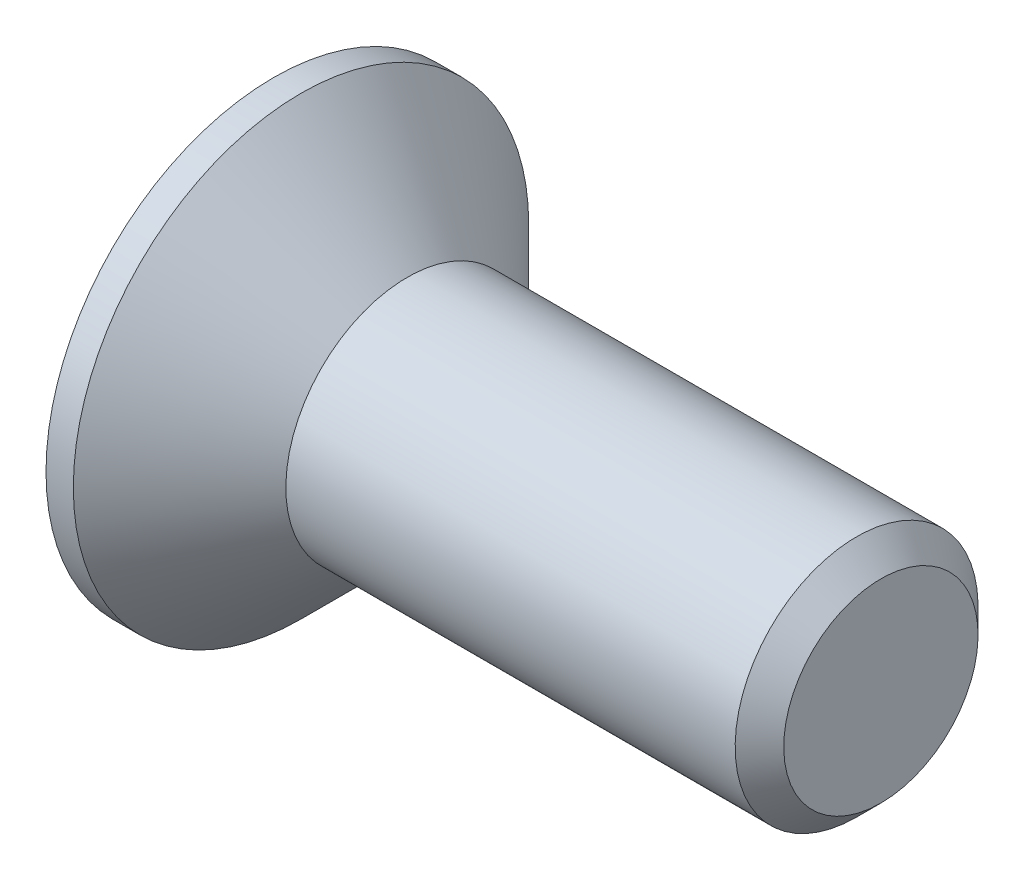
from build123d import *

# Parameters (mm, degrees)
CHAMFER1_SIZE      = 0.4
CUT_EXTRUDE1_DEPTH = 1.9


with BuildPart() as part:
    # Sketch1 → Revolve1 (revolve)
    with BuildSketch(Plane.XY, mode=Mode.PRIVATE) as revolve1_sk:
        Polygon((-2.2, 3.75), (-2.2, 0), (7.8, 0), (7.8, 2), (0, 2), (-1.75, 3.75), align=None)
    revolve(revolve1_sk.sketch.rotate(Axis((-2.2, 0, 0), (1, 0, 0)), 180), axis=Axis((-2.2, 0, 0), (1, 0, 0)))

    # Chamfer1
    chamfer1_edges = [part.edges().sort_by_distance(p)[0] for p in [
        (7.8, 2, 0),
    ]]
    chamfer(chamfer1_edges, length=CHAMFER1_SIZE)

    # Sketch2 → Cut-Extrude1 (cut)
    with BuildSketch(Plane.ZY.offset(2.2)):
        Polygon((-0.55, 2.2), (0.55, 2.2), (0.55, 0.55), (2.2, 0.55), (2.2, -0.55), (0.55, -0.55), (0.55, -2.2), (-0.55, -2.2), (-0.55, -0.55), (-2.2, -0.55), (-2.2, 0.55), (-0.55, 0.55), align=None)
    extrude(amount=-CUT_EXTRUDE1_DEPTH, mode=Mode.SUBTRACT)


solid = part.part
